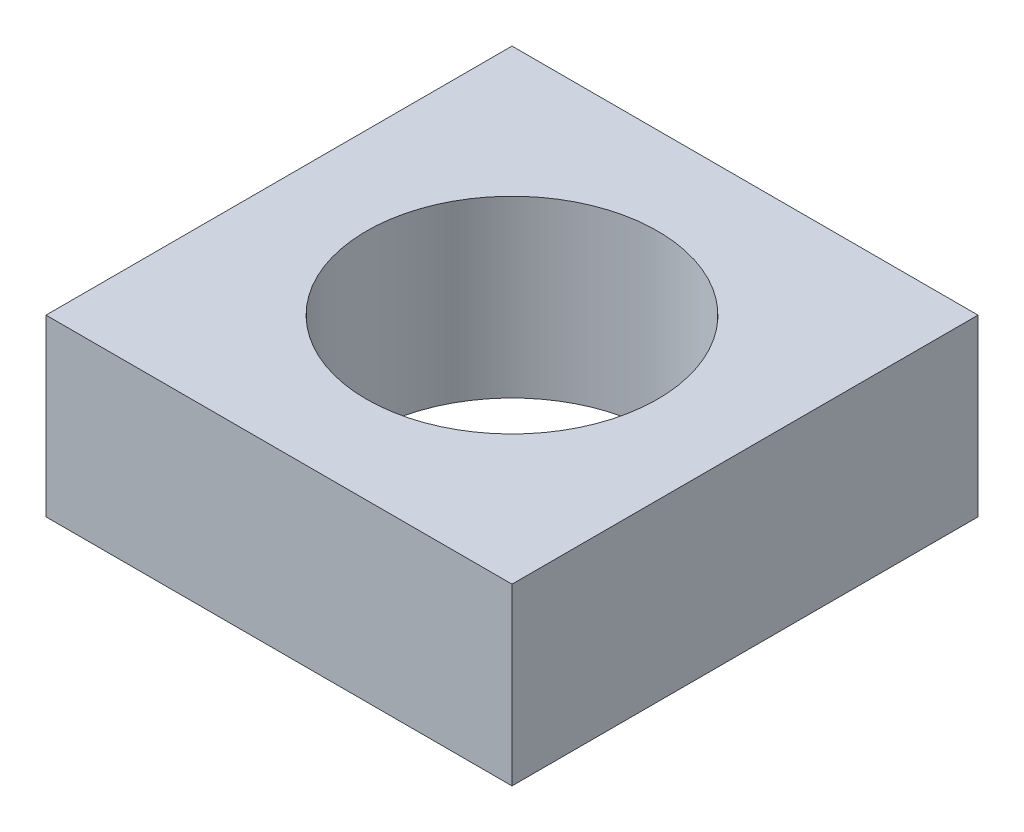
ISO-10303-21;
HEADER;
FILE_DESCRIPTION(('STEP AP214'),'2;1');
FILE_NAME('part.step','',(''),(''),'','','');
FILE_SCHEMA(('AUTOMOTIVE_DESIGN { 1 0 10303 214 1 1 1 1 }'));
ENDSEC;
DATA;
#1=APPLICATION_CONTEXT('core data for automotive mechanical design processes');
#2=APPLICATION_PROTOCOL_DEFINITION('international standard','automotive_design',2000,#1);
#3=PRODUCT_CONTEXT('',#1,'mechanical');
#4=PRODUCT('Part','Part','',(#3));
#5=PRODUCT_RELATED_PRODUCT_CATEGORY('part','',(#4));
#6=PRODUCT_DEFINITION_FORMATION('','',#4);
#7=PRODUCT_DEFINITION_CONTEXT('part definition',#1,'design');
#8=PRODUCT_DEFINITION('design','',#6,#7);
#9=PRODUCT_DEFINITION_SHAPE('','',#8);
#10=(LENGTH_UNIT() NAMED_UNIT(*) SI_UNIT(.MILLI.,.METRE.));
#11=(NAMED_UNIT(*) PLANE_ANGLE_UNIT() SI_UNIT($,.RADIAN.));
#12=(NAMED_UNIT(*) SI_UNIT($,.STERADIAN.) SOLID_ANGLE_UNIT());
#13=UNCERTAINTY_MEASURE_WITH_UNIT(LENGTH_MEASURE(1.E-05),#10,'distance_accuracy_value','');
#14=(GEOMETRIC_REPRESENTATION_CONTEXT(3) GLOBAL_UNCERTAINTY_ASSIGNED_CONTEXT((#13)) GLOBAL_UNIT_ASSIGNED_CONTEXT((#10,
#11,#12)) REPRESENTATION_CONTEXT('',''));
#15=CARTESIAN_POINT('',(0.,0.,0.));
#16=DIRECTION('',(0.,0.,1.));
#17=DIRECTION('',(1.,0.,0.));
#18=AXIS2_PLACEMENT_3D('',#15,#16,#17);
#19=CARTESIAN_POINT('',(0.,3.,0.));
#20=DIRECTION('',(0.,1.,0.));
#21=DIRECTION('',(0.,0.,1.));
#22=AXIS2_PLACEMENT_3D('',#19,#20,#21);
#23=PLANE('',#22);
#24=DIRECTION('',(0.,0.,-1.));
#25=VECTOR('',#24,1.);
#26=CARTESIAN_POINT('',(4.,3.,-4.));
#27=LINE('',#26,#25);
#28=CARTESIAN_POINT('',(4.,3.,4.));
#29=VERTEX_POINT('',#28);
#30=CARTESIAN_POINT('',(4.,3.,-4.));
#31=VERTEX_POINT('',#30);
#32=EDGE_CURVE('E87',#29,#31,#27,.T.);
#33=ORIENTED_EDGE('',*,*,#32,.T.);
#34=DIRECTION('',(-1.,0.,0.));
#35=VECTOR('',#34,1.);
#36=CARTESIAN_POINT('',(-4.,3.,-4.));
#37=LINE('',#36,#35);
#38=CARTESIAN_POINT('',(-4.,3.,-4.));
#39=VERTEX_POINT('',#38);
#40=EDGE_CURVE('E82',#31,#39,#37,.T.);
#41=ORIENTED_EDGE('',*,*,#40,.T.);
#42=DIRECTION('',(0.,0.,1.));
#43=VECTOR('',#42,1.);
#44=CARTESIAN_POINT('',(-4.,3.,-4.));
#45=LINE('',#44,#43);
#46=CARTESIAN_POINT('',(-4.,3.,4.));
#47=VERTEX_POINT('',#46);
#48=EDGE_CURVE('E85',#39,#47,#45,.T.);
#49=ORIENTED_EDGE('',*,*,#48,.T.);
#50=DIRECTION('',(1.,0.,0.));
#51=VECTOR('',#50,1.);
#52=CARTESIAN_POINT('',(-4.,3.,4.));
#53=LINE('',#52,#51);
#54=EDGE_CURVE('E52',#47,#29,#53,.T.);
#55=ORIENTED_EDGE('',*,*,#54,.T.);
#56=EDGE_LOOP('',(#33,#41,#49,#55));
#57=FACE_BOUND('',#56,.T.);
#58=CARTESIAN_POINT('',(0.,3.,0.));
#59=DIRECTION('',(0.,1.,0.));
#60=DIRECTION('',(0.,0.,1.));
#61=AXIS2_PLACEMENT_3D('',#58,#59,#60);
#62=CIRCLE('',#61,2.5);
#63=CARTESIAN_POINT('',(0.,3.,2.5));
#64=VERTEX_POINT('',#63);
#65=EDGE_CURVE('E102',#64,#64,#62,.T.);
#66=ORIENTED_EDGE('',*,*,#65,.F.);
#67=EDGE_LOOP('',(#66));
#68=FACE_BOUND('',#67,.T.);
#69=ADVANCED_FACE('F35',(#57,#68),#23,.T.);
#70=CARTESIAN_POINT('',(0.,0.,0.));
#71=DIRECTION('',(0.,1.,0.));
#72=DIRECTION('',(0.,0.,1.));
#73=AXIS2_PLACEMENT_3D('',#70,#71,#72);
#74=PLANE('',#73);
#75=DIRECTION('',(0.,0.,-1.));
#76=VECTOR('',#75,1.);
#77=CARTESIAN_POINT('',(4.,0.,-4.));
#78=LINE('',#77,#76);
#79=CARTESIAN_POINT('',(4.,0.,4.));
#80=VERTEX_POINT('',#79);
#81=CARTESIAN_POINT('',(4.,0.,-4.));
#82=VERTEX_POINT('',#81);
#83=EDGE_CURVE('E99',#80,#82,#78,.T.);
#84=ORIENTED_EDGE('',*,*,#83,.F.);
#85=DIRECTION('',(1.,0.,0.));
#86=VECTOR('',#85,1.);
#87=CARTESIAN_POINT('',(-4.,0.,4.));
#88=LINE('',#87,#86);
#89=CARTESIAN_POINT('',(-4.,0.,4.));
#90=VERTEX_POINT('',#89);
#91=EDGE_CURVE('E75',#90,#80,#88,.T.);
#92=ORIENTED_EDGE('',*,*,#91,.F.);
#93=DIRECTION('',(0.,0.,1.));
#94=VECTOR('',#93,1.);
#95=CARTESIAN_POINT('',(-4.,0.,-4.));
#96=LINE('',#95,#94);
#97=CARTESIAN_POINT('',(-4.,0.,-4.));
#98=VERTEX_POINT('',#97);
#99=EDGE_CURVE('E69',#98,#90,#96,.T.);
#100=ORIENTED_EDGE('',*,*,#99,.F.);
#101=DIRECTION('',(-1.,0.,0.));
#102=VECTOR('',#101,1.);
#103=CARTESIAN_POINT('',(-4.,0.,-4.));
#104=LINE('',#103,#102);
#105=EDGE_CURVE('E91',#82,#98,#104,.T.);
#106=ORIENTED_EDGE('',*,*,#105,.F.);
#107=EDGE_LOOP('',(#84,#92,#100,#106));
#108=FACE_BOUND('',#107,.T.);
#109=CARTESIAN_POINT('',(0.,0.,0.));
#110=DIRECTION('',(0.,1.,0.));
#111=DIRECTION('',(0.,0.,1.));
#112=AXIS2_PLACEMENT_3D('',#109,#110,#111);
#113=CIRCLE('',#112,2.5);
#114=CARTESIAN_POINT('',(0.,0.,2.5));
#115=VERTEX_POINT('',#114);
#116=EDGE_CURVE('E114',#115,#115,#113,.T.);
#117=ORIENTED_EDGE('',*,*,#116,.T.);
#118=EDGE_LOOP('',(#117));
#119=FACE_BOUND('',#118,.T.);
#120=ADVANCED_FACE('F110',(#108,#119),#74,.F.);
#121=CARTESIAN_POINT('',(4.,3.,-4.));
#122=DIRECTION('',(-1.,0.,0.));
#123=DIRECTION('',(0.,0.,1.));
#124=AXIS2_PLACEMENT_3D('',#121,#122,#123);
#125=PLANE('',#124);
#126=ORIENTED_EDGE('',*,*,#83,.T.);
#127=DIRECTION('',(0.,-1.,0.));
#128=VECTOR('',#127,1.);
#129=CARTESIAN_POINT('',(4.,3.,-4.));
#130=LINE('',#129,#128);
#131=EDGE_CURVE('E11',#31,#82,#130,.T.);
#132=ORIENTED_EDGE('',*,*,#131,.F.);
#133=ORIENTED_EDGE('',*,*,#32,.F.);
#134=DIRECTION('',(0.,-1.,0.));
#135=VECTOR('',#134,1.);
#136=CARTESIAN_POINT('',(4.,3.,4.));
#137=LINE('',#136,#135);
#138=EDGE_CURVE('E95',#29,#80,#137,.T.);
#139=ORIENTED_EDGE('',*,*,#138,.T.);
#140=EDGE_LOOP('',(#126,#132,#133,#139));
#141=FACE_BOUND('',#140,.T.);
#142=ADVANCED_FACE('F37',(#141),#125,.F.);
#143=CARTESIAN_POINT('',(-4.,3.,-4.));
#144=DIRECTION('',(0.,0.,1.));
#145=DIRECTION('',(1.,0.,0.));
#146=AXIS2_PLACEMENT_3D('',#143,#144,#145);
#147=PLANE('',#146);
#148=ORIENTED_EDGE('',*,*,#105,.T.);
#149=DIRECTION('',(0.,-1.,0.));
#150=VECTOR('',#149,1.);
#151=CARTESIAN_POINT('',(-4.,3.,-4.));
#152=LINE('',#151,#150);
#153=EDGE_CURVE('E44',#39,#98,#152,.T.);
#154=ORIENTED_EDGE('',*,*,#153,.F.);
#155=ORIENTED_EDGE('',*,*,#40,.F.);
#156=ORIENTED_EDGE('',*,*,#131,.T.);
#157=EDGE_LOOP('',(#148,#154,#155,#156));
#158=FACE_BOUND('',#157,.T.);
#159=ADVANCED_FACE('F90',(#158),#147,.F.);
#160=CARTESIAN_POINT('',(-4.,3.,-4.));
#161=DIRECTION('',(1.,0.,0.));
#162=DIRECTION('',(0.,0.,-1.));
#163=AXIS2_PLACEMENT_3D('',#160,#161,#162);
#164=PLANE('',#163);
#165=ORIENTED_EDGE('',*,*,#99,.T.);
#166=DIRECTION('',(0.,-1.,0.));
#167=VECTOR('',#166,1.);
#168=CARTESIAN_POINT('',(-4.,3.,4.));
#169=LINE('',#168,#167);
#170=EDGE_CURVE('E92',#47,#90,#169,.T.);
#171=ORIENTED_EDGE('',*,*,#170,.F.);
#172=ORIENTED_EDGE('',*,*,#48,.F.);
#173=ORIENTED_EDGE('',*,*,#153,.T.);
#174=EDGE_LOOP('',(#165,#171,#172,#173));
#175=FACE_BOUND('',#174,.T.);
#176=ADVANCED_FACE('F93',(#175),#164,.F.);
#177=CARTESIAN_POINT('',(-4.,3.,4.));
#178=DIRECTION('',(0.,0.,-1.));
#179=DIRECTION('',(-1.,0.,0.));
#180=AXIS2_PLACEMENT_3D('',#177,#178,#179);
#181=PLANE('',#180);
#182=ORIENTED_EDGE('',*,*,#91,.T.);
#183=ORIENTED_EDGE('',*,*,#138,.F.);
#184=ORIENTED_EDGE('',*,*,#54,.F.);
#185=ORIENTED_EDGE('',*,*,#170,.T.);
#186=EDGE_LOOP('',(#182,#183,#184,#185));
#187=FACE_BOUND('',#186,.T.);
#188=ADVANCED_FACE('F107',(#187),#181,.F.);
#189=CARTESIAN_POINT('',(0.,3.,0.));
#190=DIRECTION('',(0.,-1.,0.));
#191=DIRECTION('',(0.,0.,-1.));
#192=AXIS2_PLACEMENT_3D('',#189,#190,#191);
#193=CYLINDRICAL_SURFACE('',#192,2.5);
#194=ORIENTED_EDGE('',*,*,#65,.T.);
#195=EDGE_LOOP('',(#194));
#196=FACE_BOUND('',#195,.T.);
#197=ORIENTED_EDGE('',*,*,#116,.F.);
#198=EDGE_LOOP('',(#197));
#199=FACE_BOUND('',#198,.T.);
#200=ADVANCED_FACE('F120',(#196,#199),#193,.F.);
#201=CLOSED_SHELL('',(#69,#120,#142,#159,#176,#188,#200));
#202=MANIFOLD_SOLID_BREP('B2',#201);
#203=ADVANCED_BREP_SHAPE_REPRESENTATION('',(#18,#202),#14);
#204=SHAPE_DEFINITION_REPRESENTATION(#9,#203);
ENDSEC;
END-ISO-10303-21;
